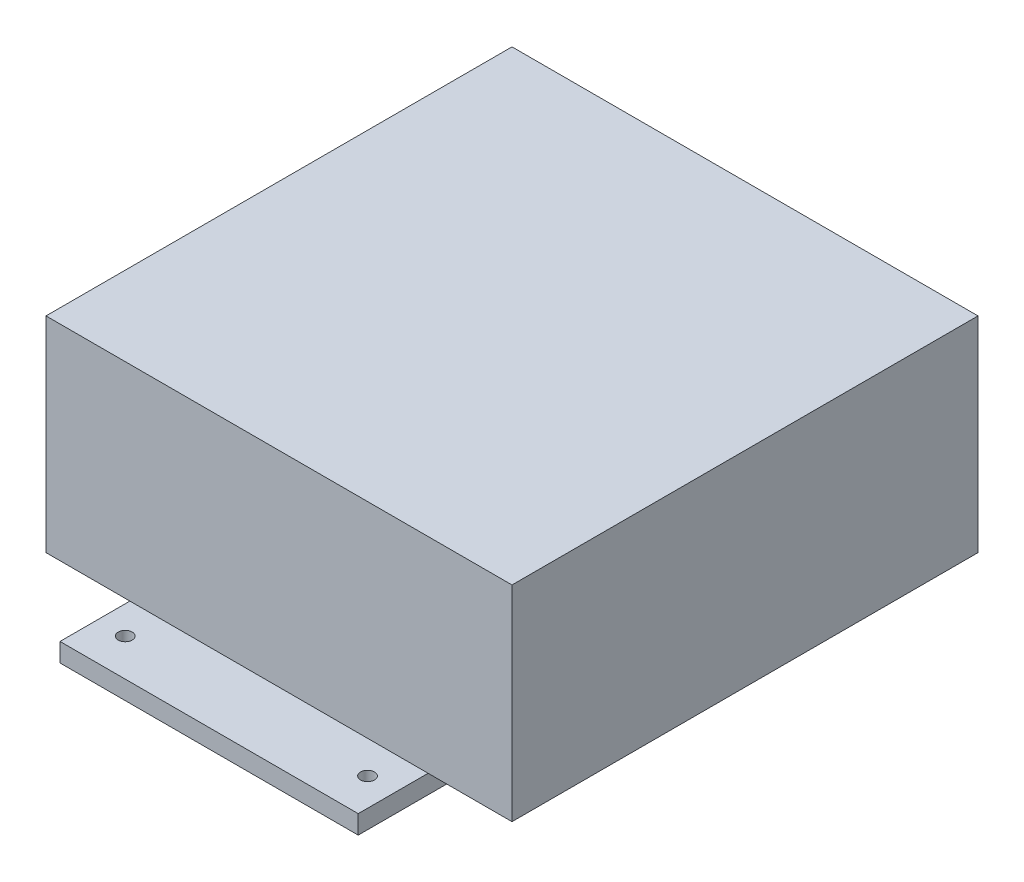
ISO-10303-21;
HEADER;
FILE_DESCRIPTION(('STEP AP214'),'2;1');
FILE_NAME('part.step','',(''),(''),'','','');
FILE_SCHEMA(('AUTOMOTIVE_DESIGN { 1 0 10303 214 1 1 1 1 }'));
ENDSEC;
DATA;
#1=APPLICATION_CONTEXT('core data for automotive mechanical design processes');
#2=APPLICATION_PROTOCOL_DEFINITION('international standard','automotive_design',2000,#1);
#3=PRODUCT_CONTEXT('',#1,'mechanical');
#4=PRODUCT('Part','Part','',(#3));
#5=PRODUCT_RELATED_PRODUCT_CATEGORY('part','',(#4));
#6=PRODUCT_DEFINITION_FORMATION('','',#4);
#7=PRODUCT_DEFINITION_CONTEXT('part definition',#1,'design');
#8=PRODUCT_DEFINITION('design','',#6,#7);
#9=PRODUCT_DEFINITION_SHAPE('','',#8);
#10=(LENGTH_UNIT() NAMED_UNIT(*) SI_UNIT(.MILLI.,.METRE.));
#11=(NAMED_UNIT(*) PLANE_ANGLE_UNIT() SI_UNIT($,.RADIAN.));
#12=(NAMED_UNIT(*) SI_UNIT($,.STERADIAN.) SOLID_ANGLE_UNIT());
#13=UNCERTAINTY_MEASURE_WITH_UNIT(LENGTH_MEASURE(1.E-05),#10,'distance_accuracy_value','');
#14=(GEOMETRIC_REPRESENTATION_CONTEXT(3) GLOBAL_UNCERTAINTY_ASSIGNED_CONTEXT((#13)) GLOBAL_UNIT_ASSIGNED_CONTEXT((#10,
#11,#12)) REPRESENTATION_CONTEXT('',''));
#15=CARTESIAN_POINT('',(0.,0.,0.));
#16=DIRECTION('',(0.,0.,1.));
#17=DIRECTION('',(1.,0.,0.));
#18=AXIS2_PLACEMENT_3D('',#15,#16,#17);
#19=CARTESIAN_POINT('',(0.,2.,0.));
#20=DIRECTION('',(0.,1.,0.));
#21=DIRECTION('',(0.,0.,1.));
#22=AXIS2_PLACEMENT_3D('',#19,#20,#21);
#23=PLANE('',#22);
#24=DIRECTION('',(1.,0.,0.));
#25=VECTOR('',#24,1.);
#26=CARTESIAN_POINT('',(-25.,2.,25.));
#27=LINE('',#26,#25);
#28=CARTESIAN_POINT('',(-16.,2.,25.));
#29=VERTEX_POINT('',#28);
#30=CARTESIAN_POINT('',(16.,2.,25.));
#31=VERTEX_POINT('',#30);
#32=EDGE_CURVE('E11',#29,#31,#27,.T.);
#33=ORIENTED_EDGE('',*,*,#32,.F.);
#34=DIRECTION('',(0.,0.,1.));
#35=VECTOR('',#34,1.);
#36=CARTESIAN_POINT('',(-16.,2.,-32.5));
#37=LINE('',#36,#35);
#38=CARTESIAN_POINT('',(-16.,2.,32.5));
#39=VERTEX_POINT('',#38);
#40=EDGE_CURVE('E175',#29,#39,#37,.T.);
#41=ORIENTED_EDGE('',*,*,#40,.T.);
#42=DIRECTION('',(1.,0.,0.));
#43=VECTOR('',#42,1.);
#44=CARTESIAN_POINT('',(-16.,2.,32.5));
#45=LINE('',#44,#43);
#46=CARTESIAN_POINT('',(16.,2.,32.5));
#47=VERTEX_POINT('',#46);
#48=EDGE_CURVE('E178',#39,#47,#45,.T.);
#49=ORIENTED_EDGE('',*,*,#48,.T.);
#50=DIRECTION('',(0.,0.,-1.));
#51=VECTOR('',#50,1.);
#52=CARTESIAN_POINT('',(16.,2.,-32.5));
#53=LINE('',#52,#51);
#54=EDGE_CURVE('E169',#47,#31,#53,.T.);
#55=ORIENTED_EDGE('',*,*,#54,.T.);
#56=EDGE_LOOP('',(#33,#41,#49,#55));
#57=FACE_BOUND('',#56,.T.);
#58=CARTESIAN_POINT('',(13.,2.,28.5));
#59=DIRECTION('',(0.,1.,0.));
#60=DIRECTION('',(0.,0.,1.));
#61=AXIS2_PLACEMENT_3D('',#58,#59,#60);
#62=CIRCLE('',#61,0.750000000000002);
#63=CARTESIAN_POINT('',(13.,2.,29.25));
#64=VERTEX_POINT('',#63);
#65=EDGE_CURVE('E157',#64,#64,#62,.T.);
#66=ORIENTED_EDGE('',*,*,#65,.F.);
#67=EDGE_LOOP('',(#66));
#68=FACE_BOUND('',#67,.T.);
#69=CARTESIAN_POINT('',(-13.,2.,28.5));
#70=DIRECTION('',(0.,1.,0.));
#71=DIRECTION('',(0.,0.,1.));
#72=AXIS2_PLACEMENT_3D('',#69,#70,#71);
#73=CIRCLE('',#72,0.75);
#74=CARTESIAN_POINT('',(-13.,2.,29.25));
#75=VERTEX_POINT('',#74);
#76=EDGE_CURVE('E151',#75,#75,#73,.T.);
#77=ORIENTED_EDGE('',*,*,#76,.F.);
#78=EDGE_LOOP('',(#77));
#79=FACE_BOUND('',#78,.T.);
#80=ADVANCED_FACE('F35',(#57,#68,#79),#23,.T.);
#81=DIRECTION('',(-1.,0.,0.));
#82=VECTOR('',#81,1.);
#83=CARTESIAN_POINT('',(-25.,2.,-25.));
#84=LINE('',#83,#82);
#85=CARTESIAN_POINT('',(16.,2.,-25.));
#86=VERTEX_POINT('',#85);
#87=CARTESIAN_POINT('',(-16.,2.,-25.));
#88=VERTEX_POINT('',#87);
#89=EDGE_CURVE('E44',#86,#88,#84,.T.);
#90=ORIENTED_EDGE('',*,*,#89,.F.);
#91=CARTESIAN_POINT('',(16.,2.,-32.5));
#92=VERTEX_POINT('',#91);
#93=EDGE_CURVE('E173',#86,#92,#53,.T.);
#94=ORIENTED_EDGE('',*,*,#93,.T.);
#95=DIRECTION('',(-1.,0.,0.));
#96=VECTOR('',#95,1.);
#97=CARTESIAN_POINT('',(-16.,2.,-32.5));
#98=LINE('',#97,#96);
#99=CARTESIAN_POINT('',(-16.,2.,-32.5));
#100=VERTEX_POINT('',#99);
#101=EDGE_CURVE('E171',#92,#100,#98,.T.);
#102=ORIENTED_EDGE('',*,*,#101,.T.);
#103=EDGE_CURVE('E176',#100,#88,#37,.T.);
#104=ORIENTED_EDGE('',*,*,#103,.T.);
#105=EDGE_LOOP('',(#90,#94,#102,#104));
#106=FACE_BOUND('',#105,.T.);
#107=CARTESIAN_POINT('',(13.,2.,-28.5));
#108=DIRECTION('',(0.,1.,0.));
#109=DIRECTION('',(0.,0.,1.));
#110=AXIS2_PLACEMENT_3D('',#107,#108,#109);
#111=CIRCLE('',#110,0.750000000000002);
#112=CARTESIAN_POINT('',(13.,2.,-27.75));
#113=VERTEX_POINT('',#112);
#114=EDGE_CURVE('E163',#113,#113,#111,.T.);
#115=ORIENTED_EDGE('',*,*,#114,.F.);
#116=EDGE_LOOP('',(#115));
#117=FACE_BOUND('',#116,.T.);
#118=CARTESIAN_POINT('',(-13.,2.,-28.5));
#119=DIRECTION('',(0.,1.,0.));
#120=DIRECTION('',(0.,0.,1.));
#121=AXIS2_PLACEMENT_3D('',#118,#119,#120);
#122=CIRCLE('',#121,0.75);
#123=CARTESIAN_POINT('',(-13.,2.,-27.75));
#124=VERTEX_POINT('',#123);
#125=EDGE_CURVE('E142',#124,#124,#122,.T.);
#126=ORIENTED_EDGE('',*,*,#125,.F.);
#127=EDGE_LOOP('',(#126));
#128=FACE_BOUND('',#127,.T.);
#129=ADVANCED_FACE('F243',(#106,#117,#128),#23,.T.);
#130=CARTESIAN_POINT('',(0.,0.,0.));
#131=DIRECTION('',(0.,1.,0.));
#132=DIRECTION('',(0.,0.,1.));
#133=AXIS2_PLACEMENT_3D('',#130,#131,#132);
#134=PLANE('',#133);
#135=DIRECTION('',(0.,0.,-1.));
#136=VECTOR('',#135,1.);
#137=CARTESIAN_POINT('',(16.,0.,-32.5));
#138=LINE('',#137,#136);
#139=CARTESIAN_POINT('',(16.,0.,32.5));
#140=VERTEX_POINT('',#139);
#141=CARTESIAN_POINT('',(16.,0.,-32.5));
#142=VERTEX_POINT('',#141);
#143=EDGE_CURVE('E166',#140,#142,#138,.T.);
#144=ORIENTED_EDGE('',*,*,#143,.F.);
#145=DIRECTION('',(1.,0.,0.));
#146=VECTOR('',#145,1.);
#147=CARTESIAN_POINT('',(-16.,0.,32.5));
#148=LINE('',#147,#146);
#149=CARTESIAN_POINT('',(-16.,0.,32.5));
#150=VERTEX_POINT('',#149);
#151=EDGE_CURVE('E188',#150,#140,#148,.T.);
#152=ORIENTED_EDGE('',*,*,#151,.F.);
#153=DIRECTION('',(0.,0.,1.));
#154=VECTOR('',#153,1.);
#155=CARTESIAN_POINT('',(-16.,0.,-32.5));
#156=LINE('',#155,#154);
#157=CARTESIAN_POINT('',(-16.,0.,-32.5));
#158=VERTEX_POINT('',#157);
#159=EDGE_CURVE('E186',#158,#150,#156,.T.);
#160=ORIENTED_EDGE('',*,*,#159,.F.);
#161=DIRECTION('',(-1.,0.,0.));
#162=VECTOR('',#161,1.);
#163=CARTESIAN_POINT('',(-16.,0.,-32.5));
#164=LINE('',#163,#162);
#165=EDGE_CURVE('E184',#142,#158,#164,.T.);
#166=ORIENTED_EDGE('',*,*,#165,.F.);
#167=EDGE_LOOP('',(#144,#152,#160,#166));
#168=FACE_BOUND('',#167,.T.);
#169=CARTESIAN_POINT('',(13.,0.,-28.5));
#170=DIRECTION('',(0.,1.,0.));
#171=DIRECTION('',(0.,0.,1.));
#172=AXIS2_PLACEMENT_3D('',#169,#170,#171);
#173=CIRCLE('',#172,0.750000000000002);
#174=CARTESIAN_POINT('',(13.,0.,-27.75));
#175=VERTEX_POINT('',#174);
#176=EDGE_CURVE('E160',#175,#175,#173,.T.);
#177=ORIENTED_EDGE('',*,*,#176,.T.);
#178=EDGE_LOOP('',(#177));
#179=FACE_BOUND('',#178,.T.);
#180=CARTESIAN_POINT('',(13.,0.,28.5));
#181=DIRECTION('',(0.,1.,0.));
#182=DIRECTION('',(0.,0.,1.));
#183=AXIS2_PLACEMENT_3D('',#180,#181,#182);
#184=CIRCLE('',#183,0.750000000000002);
#185=CARTESIAN_POINT('',(13.,0.,29.25));
#186=VERTEX_POINT('',#185);
#187=EDGE_CURVE('E154',#186,#186,#184,.T.);
#188=ORIENTED_EDGE('',*,*,#187,.T.);
#189=EDGE_LOOP('',(#188));
#190=FACE_BOUND('',#189,.T.);
#191=CARTESIAN_POINT('',(-13.,0.,28.5));
#192=DIRECTION('',(0.,1.,0.));
#193=DIRECTION('',(0.,0.,1.));
#194=AXIS2_PLACEMENT_3D('',#191,#192,#193);
#195=CIRCLE('',#194,0.75);
#196=CARTESIAN_POINT('',(-13.,0.,29.25));
#197=VERTEX_POINT('',#196);
#198=EDGE_CURVE('E149',#197,#197,#195,.T.);
#199=ORIENTED_EDGE('',*,*,#198,.T.);
#200=EDGE_LOOP('',(#199));
#201=FACE_BOUND('',#200,.T.);
#202=CARTESIAN_POINT('',(-13.,0.,-28.5));
#203=DIRECTION('',(0.,1.,0.));
#204=DIRECTION('',(0.,0.,1.));
#205=AXIS2_PLACEMENT_3D('',#202,#203,#204);
#206=CIRCLE('',#205,0.75);
#207=CARTESIAN_POINT('',(-13.,0.,-27.75));
#208=VERTEX_POINT('',#207);
#209=EDGE_CURVE('E139',#208,#208,#206,.T.);
#210=ORIENTED_EDGE('',*,*,#209,.T.);
#211=EDGE_LOOP('',(#210));
#212=FACE_BOUND('',#211,.T.);
#213=ADVANCED_FACE('F247',(#168,#179,#190,#201,#212),#134,.F.);
#214=CARTESIAN_POINT('',(16.,2.,-32.5));
#215=DIRECTION('',(-1.,0.,0.));
#216=DIRECTION('',(0.,0.,1.));
#217=AXIS2_PLACEMENT_3D('',#214,#215,#216);
#218=PLANE('',#217);
#219=ORIENTED_EDGE('',*,*,#143,.T.);
#220=DIRECTION('',(0.,-1.,0.));
#221=VECTOR('',#220,1.);
#222=CARTESIAN_POINT('',(16.,2.,-32.5));
#223=LINE('',#222,#221);
#224=EDGE_CURVE('E39',#92,#142,#223,.T.);
#225=ORIENTED_EDGE('',*,*,#224,.F.);
#226=ORIENTED_EDGE('',*,*,#93,.F.);
#227=EDGE_CURVE('E172',#31,#86,#53,.T.);
#228=ORIENTED_EDGE('',*,*,#227,.F.);
#229=ORIENTED_EDGE('',*,*,#54,.F.);
#230=DIRECTION('',(0.,-1.,0.));
#231=VECTOR('',#230,1.);
#232=CARTESIAN_POINT('',(16.,2.,32.5));
#233=LINE('',#232,#231);
#234=EDGE_CURVE('E181',#47,#140,#233,.T.);
#235=ORIENTED_EDGE('',*,*,#234,.T.);
#236=EDGE_LOOP('',(#219,#225,#226,#228,#229,#235));
#237=FACE_BOUND('',#236,.T.);
#238=ADVANCED_FACE('F37',(#237),#218,.F.);
#239=CARTESIAN_POINT('',(-16.,2.,-32.5));
#240=DIRECTION('',(0.,0.,1.));
#241=DIRECTION('',(1.,0.,0.));
#242=AXIS2_PLACEMENT_3D('',#239,#240,#241);
#243=PLANE('',#242);
#244=ORIENTED_EDGE('',*,*,#165,.T.);
#245=DIRECTION('',(0.,-1.,0.));
#246=VECTOR('',#245,1.);
#247=CARTESIAN_POINT('',(-16.,2.,-32.5));
#248=LINE('',#247,#246);
#249=EDGE_CURVE('E194',#100,#158,#248,.T.);
#250=ORIENTED_EDGE('',*,*,#249,.F.);
#251=ORIENTED_EDGE('',*,*,#101,.F.);
#252=ORIENTED_EDGE('',*,*,#224,.T.);
#253=EDGE_LOOP('',(#244,#250,#251,#252));
#254=FACE_BOUND('',#253,.T.);
#255=ADVANCED_FACE('F245',(#254),#243,.F.);
#256=CARTESIAN_POINT('',(-16.,2.,-32.5));
#257=DIRECTION('',(1.,0.,0.));
#258=DIRECTION('',(0.,0.,-1.));
#259=AXIS2_PLACEMENT_3D('',#256,#257,#258);
#260=PLANE('',#259);
#261=ORIENTED_EDGE('',*,*,#159,.T.);
#262=DIRECTION('',(0.,-1.,0.));
#263=VECTOR('',#262,1.);
#264=CARTESIAN_POINT('',(-16.,2.,32.5));
#265=LINE('',#264,#263);
#266=EDGE_CURVE('E192',#39,#150,#265,.T.);
#267=ORIENTED_EDGE('',*,*,#266,.F.);
#268=ORIENTED_EDGE('',*,*,#40,.F.);
#269=EDGE_CURVE('E179',#88,#29,#37,.T.);
#270=ORIENTED_EDGE('',*,*,#269,.F.);
#271=ORIENTED_EDGE('',*,*,#103,.F.);
#272=ORIENTED_EDGE('',*,*,#249,.T.);
#273=EDGE_LOOP('',(#261,#267,#268,#270,#271,#272));
#274=FACE_BOUND('',#273,.T.);
#275=ADVANCED_FACE('F233',(#274),#260,.F.);
#276=CARTESIAN_POINT('',(-16.,2.,32.5));
#277=DIRECTION('',(0.,0.,-1.));
#278=DIRECTION('',(-1.,0.,0.));
#279=AXIS2_PLACEMENT_3D('',#276,#277,#278);
#280=PLANE('',#279);
#281=ORIENTED_EDGE('',*,*,#151,.T.);
#282=ORIENTED_EDGE('',*,*,#234,.F.);
#283=ORIENTED_EDGE('',*,*,#48,.F.);
#284=ORIENTED_EDGE('',*,*,#266,.T.);
#285=EDGE_LOOP('',(#281,#282,#283,#284));
#286=FACE_BOUND('',#285,.T.);
#287=ADVANCED_FACE('F236',(#286),#280,.F.);
#288=CARTESIAN_POINT('',(13.,2.,-28.5));
#289=DIRECTION('',(0.,-1.,0.));
#290=DIRECTION('',(0.,0.,-1.));
#291=AXIS2_PLACEMENT_3D('',#288,#289,#290);
#292=CYLINDRICAL_SURFACE('',#291,0.750000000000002);
#293=ORIENTED_EDGE('',*,*,#114,.T.);
#294=EDGE_LOOP('',(#293));
#295=FACE_BOUND('',#294,.T.);
#296=ORIENTED_EDGE('',*,*,#176,.F.);
#297=EDGE_LOOP('',(#296));
#298=FACE_BOUND('',#297,.T.);
#299=ADVANCED_FACE('F279',(#295,#298),#292,.F.);
#300=CARTESIAN_POINT('',(13.,2.,28.5));
#301=DIRECTION('',(0.,-1.,0.));
#302=DIRECTION('',(0.,0.,-1.));
#303=AXIS2_PLACEMENT_3D('',#300,#301,#302);
#304=CYLINDRICAL_SURFACE('',#303,0.750000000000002);
#305=ORIENTED_EDGE('',*,*,#65,.T.);
#306=EDGE_LOOP('',(#305));
#307=FACE_BOUND('',#306,.T.);
#308=ORIENTED_EDGE('',*,*,#187,.F.);
#309=EDGE_LOOP('',(#308));
#310=FACE_BOUND('',#309,.T.);
#311=ADVANCED_FACE('F269',(#307,#310),#304,.F.);
#312=CARTESIAN_POINT('',(-13.,2.,28.5));
#313=DIRECTION('',(0.,-1.,0.));
#314=DIRECTION('',(0.,0.,-1.));
#315=AXIS2_PLACEMENT_3D('',#312,#313,#314);
#316=CYLINDRICAL_SURFACE('',#315,0.75);
#317=ORIENTED_EDGE('',*,*,#76,.T.);
#318=EDGE_LOOP('',(#317));
#319=FACE_BOUND('',#318,.T.);
#320=ORIENTED_EDGE('',*,*,#198,.F.);
#321=EDGE_LOOP('',(#320));
#322=FACE_BOUND('',#321,.T.);
#323=ADVANCED_FACE('F261',(#319,#322),#316,.F.);
#324=CARTESIAN_POINT('',(-13.,2.,-28.5));
#325=DIRECTION('',(0.,-1.,0.));
#326=DIRECTION('',(0.,0.,-1.));
#327=AXIS2_PLACEMENT_3D('',#324,#325,#326);
#328=CYLINDRICAL_SURFACE('',#327,0.75);
#329=ORIENTED_EDGE('',*,*,#125,.T.);
#330=EDGE_LOOP('',(#329));
#331=FACE_BOUND('',#330,.T.);
#332=ORIENTED_EDGE('',*,*,#209,.F.);
#333=EDGE_LOOP('',(#332));
#334=FACE_BOUND('',#333,.T.);
#335=ADVANCED_FACE('F259',(#331,#334),#328,.F.);
#336=CARTESIAN_POINT('',(0.,2.,0.));
#337=DIRECTION('',(0.,1.,0.));
#338=DIRECTION('',(0.,0.,1.));
#339=AXIS2_PLACEMENT_3D('',#336,#337,#338);
#340=PLANE('',#339);
#341=CARTESIAN_POINT('',(25.,2.,25.));
#342=VERTEX_POINT('',#341);
#343=EDGE_CURVE('E47',#31,#342,#27,.T.);
#344=ORIENTED_EDGE('',*,*,#343,.F.);
#345=ORIENTED_EDGE('',*,*,#227,.T.);
#346=CARTESIAN_POINT('',(25.,2.,-25.));
#347=VERTEX_POINT('',#346);
#348=EDGE_CURVE('E205',#347,#86,#84,.T.);
#349=ORIENTED_EDGE('',*,*,#348,.F.);
#350=DIRECTION('',(0.,0.,-1.));
#351=VECTOR('',#350,1.);
#352=CARTESIAN_POINT('',(25.,2.,-25.));
#353=LINE('',#352,#351);
#354=EDGE_CURVE('E138',#342,#347,#353,.T.);
#355=ORIENTED_EDGE('',*,*,#354,.F.);
#356=EDGE_LOOP('',(#344,#345,#349,#355));
#357=FACE_BOUND('',#356,.T.);
#358=ADVANCED_FACE('F242',(#357),#340,.F.);
#359=CARTESIAN_POINT('',(-25.,2.,-25.));
#360=VERTEX_POINT('',#359);
#361=EDGE_CURVE('E206',#88,#360,#84,.T.);
#362=ORIENTED_EDGE('',*,*,#361,.F.);
#363=ORIENTED_EDGE('',*,*,#269,.T.);
#364=CARTESIAN_POINT('',(-25.,2.,25.));
#365=VERTEX_POINT('',#364);
#366=EDGE_CURVE('E46',#365,#29,#27,.T.);
#367=ORIENTED_EDGE('',*,*,#366,.F.);
#368=DIRECTION('',(0.,0.,1.));
#369=VECTOR('',#368,1.);
#370=CARTESIAN_POINT('',(-25.,2.,-25.));
#371=LINE('',#370,#369);
#372=EDGE_CURVE('E209',#360,#365,#371,.T.);
#373=ORIENTED_EDGE('',*,*,#372,.F.);
#374=EDGE_LOOP('',(#362,#363,#367,#373));
#375=FACE_BOUND('',#374,.T.);
#376=ADVANCED_FACE('F227',(#375),#340,.F.);
#377=CARTESIAN_POINT('',(25.,24.,-25.));
#378=DIRECTION('',(-1.,0.,0.));
#379=DIRECTION('',(0.,0.,1.));
#380=AXIS2_PLACEMENT_3D('',#377,#378,#379);
#381=PLANE('',#380);
#382=ORIENTED_EDGE('',*,*,#354,.T.);
#383=DIRECTION('',(0.,-1.,0.));
#384=VECTOR('',#383,1.);
#385=CARTESIAN_POINT('',(25.,24.,-25.));
#386=LINE('',#385,#384);
#387=CARTESIAN_POINT('',(25.,24.,-25.));
#388=VERTEX_POINT('',#387);
#389=EDGE_CURVE('E119',#388,#347,#386,.T.);
#390=ORIENTED_EDGE('',*,*,#389,.F.);
#391=DIRECTION('',(0.,0.,-1.));
#392=VECTOR('',#391,1.);
#393=CARTESIAN_POINT('',(25.,24.,-25.));
#394=LINE('',#393,#392);
#395=CARTESIAN_POINT('',(25.,24.,25.));
#396=VERTEX_POINT('',#395);
#397=EDGE_CURVE('E126',#396,#388,#394,.T.);
#398=ORIENTED_EDGE('',*,*,#397,.F.);
#399=DIRECTION('',(0.,-1.,0.));
#400=VECTOR('',#399,1.);
#401=CARTESIAN_POINT('',(25.,24.,25.));
#402=LINE('',#401,#400);
#403=EDGE_CURVE('E213',#396,#342,#402,.T.);
#404=ORIENTED_EDGE('',*,*,#403,.T.);
#405=EDGE_LOOP('',(#382,#390,#398,#404));
#406=FACE_BOUND('',#405,.T.);
#407=ADVANCED_FACE('F136',(#406),#381,.F.);
#408=CARTESIAN_POINT('',(-25.,24.,-25.));
#409=DIRECTION('',(0.,0.,1.));
#410=DIRECTION('',(1.,0.,0.));
#411=AXIS2_PLACEMENT_3D('',#408,#409,#410);
#412=PLANE('',#411);
#413=ORIENTED_EDGE('',*,*,#348,.T.);
#414=ORIENTED_EDGE('',*,*,#89,.T.);
#415=ORIENTED_EDGE('',*,*,#361,.T.);
#416=DIRECTION('',(0.,-1.,0.));
#417=VECTOR('',#416,1.);
#418=CARTESIAN_POINT('',(-25.,24.,-25.));
#419=LINE('',#418,#417);
#420=CARTESIAN_POINT('',(-25.,24.,-25.));
#421=VERTEX_POINT('',#420);
#422=EDGE_CURVE('E122',#421,#360,#419,.T.);
#423=ORIENTED_EDGE('',*,*,#422,.F.);
#424=DIRECTION('',(-1.,0.,0.));
#425=VECTOR('',#424,1.);
#426=CARTESIAN_POINT('',(-25.,24.,-25.));
#427=LINE('',#426,#425);
#428=EDGE_CURVE('E114',#388,#421,#427,.T.);
#429=ORIENTED_EDGE('',*,*,#428,.F.);
#430=ORIENTED_EDGE('',*,*,#389,.T.);
#431=EDGE_LOOP('',(#413,#414,#415,#423,#429,#430));
#432=FACE_BOUND('',#431,.T.);
#433=ADVANCED_FACE('F117',(#432),#412,.F.);
#434=CARTESIAN_POINT('',(-25.,24.,-25.));
#435=DIRECTION('',(1.,0.,0.));
#436=DIRECTION('',(0.,0.,-1.));
#437=AXIS2_PLACEMENT_3D('',#434,#435,#436);
#438=PLANE('',#437);
#439=ORIENTED_EDGE('',*,*,#372,.T.);
#440=DIRECTION('',(0.,-1.,0.));
#441=VECTOR('',#440,1.);
#442=CARTESIAN_POINT('',(-25.,24.,25.));
#443=LINE('',#442,#441);
#444=CARTESIAN_POINT('',(-25.,24.,25.));
#445=VERTEX_POINT('',#444);
#446=EDGE_CURVE('E144',#445,#365,#443,.T.);
#447=ORIENTED_EDGE('',*,*,#446,.F.);
#448=DIRECTION('',(0.,0.,1.));
#449=VECTOR('',#448,1.);
#450=CARTESIAN_POINT('',(-25.,24.,-25.));
#451=LINE('',#450,#449);
#452=EDGE_CURVE('E125',#421,#445,#451,.T.);
#453=ORIENTED_EDGE('',*,*,#452,.F.);
#454=ORIENTED_EDGE('',*,*,#422,.T.);
#455=EDGE_LOOP('',(#439,#447,#453,#454));
#456=FACE_BOUND('',#455,.T.);
#457=ADVANCED_FACE('F217',(#456),#438,.F.);
#458=CARTESIAN_POINT('',(-25.,24.,25.));
#459=DIRECTION('',(0.,0.,-1.));
#460=DIRECTION('',(-1.,0.,0.));
#461=AXIS2_PLACEMENT_3D('',#458,#459,#460);
#462=PLANE('',#461);
#463=ORIENTED_EDGE('',*,*,#366,.T.);
#464=ORIENTED_EDGE('',*,*,#32,.T.);
#465=ORIENTED_EDGE('',*,*,#343,.T.);
#466=ORIENTED_EDGE('',*,*,#403,.F.);
#467=DIRECTION('',(1.,0.,0.));
#468=VECTOR('',#467,1.);
#469=CARTESIAN_POINT('',(-25.,24.,25.));
#470=LINE('',#469,#468);
#471=EDGE_CURVE('E131',#445,#396,#470,.T.);
#472=ORIENTED_EDGE('',*,*,#471,.F.);
#473=ORIENTED_EDGE('',*,*,#446,.T.);
#474=EDGE_LOOP('',(#463,#464,#465,#466,#472,#473));
#475=FACE_BOUND('',#474,.T.);
#476=ADVANCED_FACE('F222',(#475),#462,.F.);
#477=CARTESIAN_POINT('',(0.,24.,0.));
#478=DIRECTION('',(0.,1.,0.));
#479=DIRECTION('',(0.,0.,1.));
#480=AXIS2_PLACEMENT_3D('',#477,#478,#479);
#481=PLANE('',#480);
#482=ORIENTED_EDGE('',*,*,#397,.T.);
#483=ORIENTED_EDGE('',*,*,#428,.T.);
#484=ORIENTED_EDGE('',*,*,#452,.T.);
#485=ORIENTED_EDGE('',*,*,#471,.T.);
#486=EDGE_LOOP('',(#482,#483,#484,#485));
#487=FACE_BOUND('',#486,.T.);
#488=ADVANCED_FACE('F129',(#487),#481,.T.);
#489=CLOSED_SHELL('',(#80,#129,#213,#238,#255,#275,#287,#299,#311,#323,#335,#358,#376,#407,#433,
#457,#476,#488));
#490=MANIFOLD_SOLID_BREP('B2',#489);
#491=ADVANCED_BREP_SHAPE_REPRESENTATION('',(#18,#490),#14);
#492=SHAPE_DEFINITION_REPRESENTATION(#9,#491);
ENDSEC;
END-ISO-10303-21;
